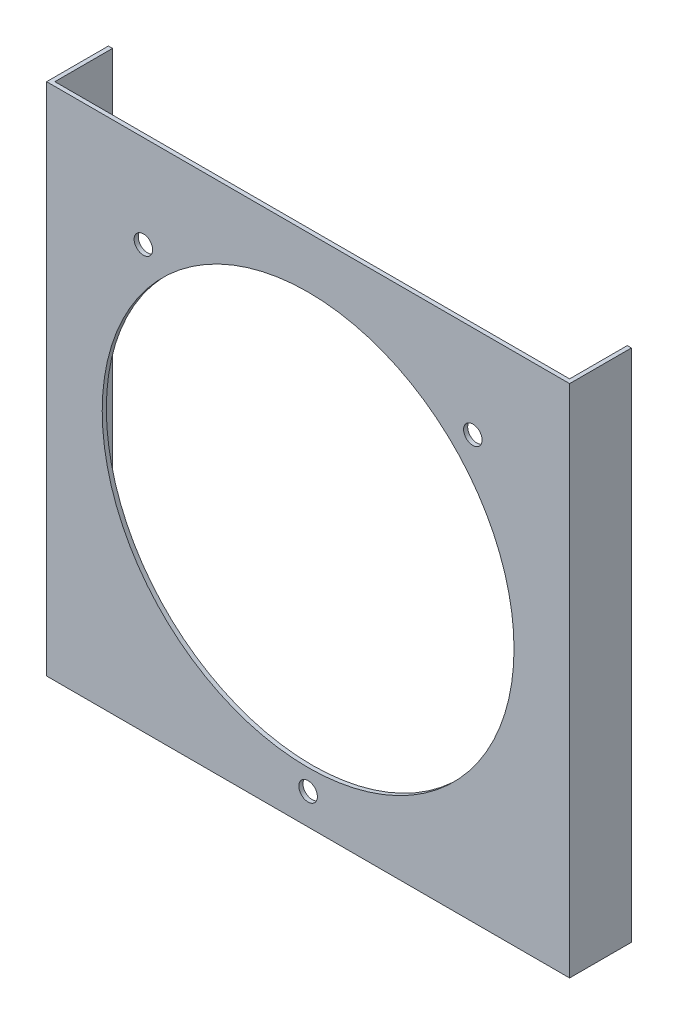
ISO-10303-21;
HEADER;
FILE_DESCRIPTION(('STEP AP214'),'2;1');
FILE_NAME('part.step','',(''),(''),'','','');
FILE_SCHEMA(('AUTOMOTIVE_DESIGN { 1 0 10303 214 1 1 1 1 }'));
ENDSEC;
DATA;
#1=APPLICATION_CONTEXT('core data for automotive mechanical design processes');
#2=APPLICATION_PROTOCOL_DEFINITION('international standard','automotive_design',2000,#1);
#3=PRODUCT_CONTEXT('',#1,'mechanical');
#4=PRODUCT('Part','Part','',(#3));
#5=PRODUCT_RELATED_PRODUCT_CATEGORY('part','',(#4));
#6=PRODUCT_DEFINITION_FORMATION('','',#4);
#7=PRODUCT_DEFINITION_CONTEXT('part definition',#1,'design');
#8=PRODUCT_DEFINITION('design','',#6,#7);
#9=PRODUCT_DEFINITION_SHAPE('','',#8);
#10=(LENGTH_UNIT() NAMED_UNIT(*) SI_UNIT(.MILLI.,.METRE.));
#11=(NAMED_UNIT(*) PLANE_ANGLE_UNIT() SI_UNIT($,.RADIAN.));
#12=(NAMED_UNIT(*) SI_UNIT($,.STERADIAN.) SOLID_ANGLE_UNIT());
#13=UNCERTAINTY_MEASURE_WITH_UNIT(LENGTH_MEASURE(1.E-05),#10,'distance_accuracy_value','');
#14=(GEOMETRIC_REPRESENTATION_CONTEXT(3) GLOBAL_UNCERTAINTY_ASSIGNED_CONTEXT((#13)) GLOBAL_UNIT_ASSIGNED_CONTEXT((#10,
#11,#12)) REPRESENTATION_CONTEXT('',''));
#15=CARTESIAN_POINT('',(0.,0.,0.));
#16=DIRECTION('',(0.,0.,1.));
#17=DIRECTION('',(1.,0.,0.));
#18=AXIS2_PLACEMENT_3D('',#15,#16,#17);
#19=CARTESIAN_POINT('',(0.,2.22044604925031E-13,2.));
#20=DIRECTION('',(0.,0.,-1.));
#21=DIRECTION('',(-0.999999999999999,0.,0.));
#22=AXIS2_PLACEMENT_3D('',#19,#20,#21);
#23=PLANE('',#22);
#24=DIRECTION('',(0.999999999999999,0.,0.));
#25=VECTOR('',#24,1.);
#26=CARTESIAN_POINT('',(-125.,-125.,1.99999999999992));
#27=LINE('',#26,#25);
#28=CARTESIAN_POINT('',(-127.,-125.,1.99999999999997));
#29=VERTEX_POINT('',#28);
#30=CARTESIAN_POINT('',(127.,-125.,2.0000000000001));
#31=VERTEX_POINT('',#30);
#32=EDGE_CURVE('E11',#29,#31,#27,.T.);
#33=ORIENTED_EDGE('',*,*,#32,.T.);
#34=DIRECTION('',(0.,1.,0.));
#35=VECTOR('',#34,1.);
#36=CARTESIAN_POINT('',(127.,125.,2.00000000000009));
#37=LINE('',#36,#35);
#38=CARTESIAN_POINT('',(127.,125.,2.00000000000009));
#39=VERTEX_POINT('',#38);
#40=EDGE_CURVE('E109',#31,#39,#37,.T.);
#41=ORIENTED_EDGE('',*,*,#40,.T.);
#42=DIRECTION('',(-0.999999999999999,0.,0.));
#43=VECTOR('',#42,1.);
#44=CARTESIAN_POINT('',(-125.,125.,1.99999999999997));
#45=LINE('',#44,#43);
#46=CARTESIAN_POINT('',(-127.,125.,1.99999999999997));
#47=VERTEX_POINT('',#46);
#48=EDGE_CURVE('E50',#39,#47,#45,.T.);
#49=ORIENTED_EDGE('',*,*,#48,.T.);
#50=DIRECTION('',(0.,1.,0.));
#51=VECTOR('',#50,1.);
#52=CARTESIAN_POINT('',(-127.,125.,1.99999999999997));
#53=LINE('',#52,#51);
#54=EDGE_CURVE('E112',#29,#47,#53,.T.);
#55=ORIENTED_EDGE('',*,*,#54,.F.);
#56=EDGE_LOOP('',(#33,#41,#49,#55));
#57=FACE_BOUND('',#56,.T.);
#58=CARTESIAN_POINT('',(0.,2.22044604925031E-13,2.));
#59=DIRECTION('',(0.,0.,1.));
#60=DIRECTION('',(0.999999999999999,0.,0.));
#61=AXIS2_PLACEMENT_3D('',#58,#59,#60);
#62=CIRCLE('',#61,100.);
#63=CARTESIAN_POINT('',(99.9999999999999,2.13717932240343E-13,2.00000000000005));
#64=VERTEX_POINT('',#63);
#65=EDGE_CURVE('E182',#64,#64,#62,.T.);
#66=ORIENTED_EDGE('',*,*,#65,.F.);
#67=EDGE_LOOP('',(#66));
#68=FACE_BOUND('',#67,.T.);
#69=CARTESIAN_POINT('',(79.9999999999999,80.0000000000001,2.00000000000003));
#70=DIRECTION('',(0.,0.,1.));
#71=DIRECTION('',(0.999999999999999,0.,0.));
#72=AXIS2_PLACEMENT_3D('',#69,#70,#71);
#73=CIRCLE('',#72,4.50000000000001);
#74=CARTESIAN_POINT('',(84.4999999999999,80.0000000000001,2.00000000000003));
#75=VERTEX_POINT('',#74);
#76=EDGE_CURVE('E176',#75,#75,#73,.T.);
#77=ORIENTED_EDGE('',*,*,#76,.F.);
#78=EDGE_LOOP('',(#77));
#79=FACE_BOUND('',#78,.T.);
#80=CARTESIAN_POINT('',(-80.,80.0000000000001,2.));
#81=DIRECTION('',(0.,0.,1.));
#82=DIRECTION('',(0.999999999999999,0.,0.));
#83=AXIS2_PLACEMENT_3D('',#80,#81,#82);
#84=CIRCLE('',#83,4.50000000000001);
#85=CARTESIAN_POINT('',(-75.5,80.0000000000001,2.));
#86=VERTEX_POINT('',#85);
#87=EDGE_CURVE('E170',#86,#86,#84,.T.);
#88=ORIENTED_EDGE('',*,*,#87,.F.);
#89=EDGE_LOOP('',(#88));
#90=FACE_BOUND('',#89,.T.);
#91=CARTESIAN_POINT('',(0.,-110.,1.99999999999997));
#92=DIRECTION('',(0.,0.,1.));
#93=DIRECTION('',(0.999999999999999,0.,0.));
#94=AXIS2_PLACEMENT_3D('',#91,#92,#93);
#95=CIRCLE('',#94,4.5);
#96=CARTESIAN_POINT('',(4.5,-110.,1.99999999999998));
#97=VERTEX_POINT('',#96);
#98=EDGE_CURVE('E164',#97,#97,#95,.T.);
#99=ORIENTED_EDGE('',*,*,#98,.F.);
#100=EDGE_LOOP('',(#99));
#101=FACE_BOUND('',#100,.T.);
#102=ADVANCED_FACE('F41',(#57,#68,#79,#90,#101),#23,.F.);
#103=CARTESIAN_POINT('',(0.,0.,0.));
#104=DIRECTION('',(0.,0.,-1.));
#105=DIRECTION('',(-0.999999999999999,0.,0.));
#106=AXIS2_PLACEMENT_3D('',#103,#104,#105);
#107=PLANE('',#106);
#108=CARTESIAN_POINT('',(-80.,80.0000000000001,0.));
#109=DIRECTION('',(0.,0.,1.));
#110=DIRECTION('',(0.999999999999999,0.,0.));
#111=AXIS2_PLACEMENT_3D('',#108,#109,#110);
#112=CIRCLE('',#111,4.50000000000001);
#113=CARTESIAN_POINT('',(-75.5,80.0000000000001,0.));
#114=VERTEX_POINT('',#113);
#115=EDGE_CURVE('E167',#114,#114,#112,.T.);
#116=ORIENTED_EDGE('',*,*,#115,.T.);
#117=EDGE_LOOP('',(#116));
#118=FACE_BOUND('',#117,.T.);
#119=CARTESIAN_POINT('',(0.,0.,0.));
#120=DIRECTION('',(0.,0.,1.));
#121=DIRECTION('',(0.999999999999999,0.,0.));
#122=AXIS2_PLACEMENT_3D('',#119,#120,#121);
#123=CIRCLE('',#122,100.);
#124=CARTESIAN_POINT('',(99.9999999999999,0.,0.));
#125=VERTEX_POINT('',#124);
#126=EDGE_CURVE('E179',#125,#125,#123,.T.);
#127=ORIENTED_EDGE('',*,*,#126,.T.);
#128=EDGE_LOOP('',(#127));
#129=FACE_BOUND('',#128,.T.);
#130=DIRECTION('',(0.,1.,0.));
#131=VECTOR('',#130,1.);
#132=CARTESIAN_POINT('',(125.,-125.,1.2490009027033E-13));
#133=LINE('',#132,#131);
#134=CARTESIAN_POINT('',(125.,-125.,1.2490009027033E-13));
#135=VERTEX_POINT('',#134);
#136=CARTESIAN_POINT('',(125.,125.,0.));
#137=VERTEX_POINT('',#136);
#138=EDGE_CURVE('E185',#135,#137,#133,.T.);
#139=ORIENTED_EDGE('',*,*,#138,.F.);
#140=DIRECTION('',(0.999999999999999,0.,0.));
#141=VECTOR('',#140,1.);
#142=CARTESIAN_POINT('',(-125.,-125.,0.));
#143=LINE('',#142,#141);
#144=CARTESIAN_POINT('',(-125.,-125.,0.));
#145=VERTEX_POINT('',#144);
#146=EDGE_CURVE('E45',#145,#135,#143,.T.);
#147=ORIENTED_EDGE('',*,*,#146,.F.);
#148=DIRECTION('',(0.,-1.,0.));
#149=VECTOR('',#148,1.);
#150=CARTESIAN_POINT('',(-125.,-125.,0.));
#151=LINE('',#150,#149);
#152=CARTESIAN_POINT('',(-125.,125.,0.));
#153=VERTEX_POINT('',#152);
#154=EDGE_CURVE('E191',#153,#145,#151,.T.);
#155=ORIENTED_EDGE('',*,*,#154,.F.);
#156=DIRECTION('',(-0.999999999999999,0.,0.));
#157=VECTOR('',#156,1.);
#158=CARTESIAN_POINT('',(-125.,125.,0.));
#159=LINE('',#158,#157);
#160=EDGE_CURVE('E65',#137,#153,#159,.T.);
#161=ORIENTED_EDGE('',*,*,#160,.F.);
#162=EDGE_LOOP('',(#139,#147,#155,#161));
#163=FACE_BOUND('',#162,.T.);
#164=CARTESIAN_POINT('',(79.9999999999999,79.9999999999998,0.));
#165=DIRECTION('',(0.,0.,1.));
#166=DIRECTION('',(0.999999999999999,0.,0.));
#167=AXIS2_PLACEMENT_3D('',#164,#165,#166);
#168=CIRCLE('',#167,4.50000000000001);
#169=CARTESIAN_POINT('',(84.4999999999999,79.9999999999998,0.));
#170=VERTEX_POINT('',#169);
#171=EDGE_CURVE('E173',#170,#170,#168,.T.);
#172=ORIENTED_EDGE('',*,*,#171,.T.);
#173=EDGE_LOOP('',(#172));
#174=FACE_BOUND('',#173,.T.);
#175=CARTESIAN_POINT('',(0.,-110.,0.));
#176=DIRECTION('',(0.,0.,1.));
#177=DIRECTION('',(0.999999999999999,0.,0.));
#178=AXIS2_PLACEMENT_3D('',#175,#176,#177);
#179=CIRCLE('',#178,4.5);
#180=CARTESIAN_POINT('',(4.50000000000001,-110.,0.));
#181=VERTEX_POINT('',#180);
#182=EDGE_CURVE('E163',#181,#181,#179,.T.);
#183=ORIENTED_EDGE('',*,*,#182,.T.);
#184=EDGE_LOOP('',(#183));
#185=FACE_BOUND('',#184,.T.);
#186=ADVANCED_FACE('F219',(#118,#129,#163,#174,#185),#107,.T.);
#187=CARTESIAN_POINT('',(-125.,125.,1.99999999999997));
#188=DIRECTION('',(0.,-1.,0.));
#189=DIRECTION('',(0.,0.,-1.));
#190=AXIS2_PLACEMENT_3D('',#187,#188,#189);
#191=PLANE('',#190);
#192=ORIENTED_EDGE('',*,*,#160,.T.);
#193=DIRECTION('',(0.,0.,-1.));
#194=VECTOR('',#193,1.);
#195=CARTESIAN_POINT('',(-125.,125.,1.99999999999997));
#196=LINE('',#195,#194);
#197=CARTESIAN_POINT('',(-125.,125.,-28.));
#198=VERTEX_POINT('',#197);
#199=EDGE_CURVE('E144',#153,#198,#196,.T.);
#200=ORIENTED_EDGE('',*,*,#199,.T.);
#201=DIRECTION('',(0.999999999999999,0.,0.));
#202=VECTOR('',#201,1.);
#203=CARTESIAN_POINT('',(-127.,125.,-28.));
#204=LINE('',#203,#202);
#205=CARTESIAN_POINT('',(-127.,125.,-28.));
#206=VERTEX_POINT('',#205);
#207=EDGE_CURVE('E160',#206,#198,#204,.T.);
#208=ORIENTED_EDGE('',*,*,#207,.F.);
#209=DIRECTION('',(0.,0.,-1.));
#210=VECTOR('',#209,1.);
#211=CARTESIAN_POINT('',(-127.,125.,1.99999999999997));
#212=LINE('',#211,#210);
#213=EDGE_CURVE('E146',#47,#206,#212,.T.);
#214=ORIENTED_EDGE('',*,*,#213,.F.);
#215=ORIENTED_EDGE('',*,*,#48,.F.);
#216=DIRECTION('',(0.,0.,-1.));
#217=VECTOR('',#216,1.);
#218=CARTESIAN_POINT('',(127.,125.,2.00000000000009));
#219=LINE('',#218,#217);
#220=CARTESIAN_POINT('',(127.,125.,-27.9999999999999));
#221=VERTEX_POINT('',#220);
#222=EDGE_CURVE('E123',#39,#221,#219,.T.);
#223=ORIENTED_EDGE('',*,*,#222,.T.);
#224=DIRECTION('',(-0.999999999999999,0.,0.));
#225=VECTOR('',#224,1.);
#226=CARTESIAN_POINT('',(127.,125.,-27.9999999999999));
#227=LINE('',#226,#225);
#228=CARTESIAN_POINT('',(125.,125.,-27.9999999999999));
#229=VERTEX_POINT('',#228);
#230=EDGE_CURVE('E133',#221,#229,#227,.T.);
#231=ORIENTED_EDGE('',*,*,#230,.T.);
#232=DIRECTION('',(0.,0.,-1.));
#233=VECTOR('',#232,1.);
#234=CARTESIAN_POINT('',(125.,125.,2.00000000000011));
#235=LINE('',#234,#233);
#236=EDGE_CURVE('E124',#137,#229,#235,.T.);
#237=ORIENTED_EDGE('',*,*,#236,.F.);
#238=EDGE_LOOP('',(#192,#200,#208,#214,#215,#223,#231,#237));
#239=FACE_BOUND('',#238,.T.);
#240=ADVANCED_FACE('F43',(#239),#191,.F.);
#241=CARTESIAN_POINT('',(-125.,-125.,1.99999999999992));
#242=DIRECTION('',(0.,1.,0.));
#243=DIRECTION('',(0.,0.,1.));
#244=AXIS2_PLACEMENT_3D('',#241,#242,#243);
#245=PLANE('',#244);
#246=ORIENTED_EDGE('',*,*,#146,.T.);
#247=DIRECTION('',(0.,0.,1.));
#248=VECTOR('',#247,1.);
#249=CARTESIAN_POINT('',(125.,-125.,2.00000000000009));
#250=LINE('',#249,#248);
#251=CARTESIAN_POINT('',(125.,-125.,-27.9999999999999));
#252=VERTEX_POINT('',#251);
#253=EDGE_CURVE('E134',#252,#135,#250,.T.);
#254=ORIENTED_EDGE('',*,*,#253,.F.);
#255=DIRECTION('',(-0.999999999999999,0.,0.));
#256=VECTOR('',#255,1.);
#257=CARTESIAN_POINT('',(127.,-125.,-27.9999999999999));
#258=LINE('',#257,#256);
#259=CARTESIAN_POINT('',(127.,-125.,-27.9999999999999));
#260=VERTEX_POINT('',#259);
#261=EDGE_CURVE('E127',#260,#252,#258,.T.);
#262=ORIENTED_EDGE('',*,*,#261,.F.);
#263=DIRECTION('',(0.,0.,1.));
#264=VECTOR('',#263,1.);
#265=CARTESIAN_POINT('',(127.,-125.,2.0000000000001));
#266=LINE('',#265,#264);
#267=EDGE_CURVE('E120',#260,#31,#266,.T.);
#268=ORIENTED_EDGE('',*,*,#267,.T.);
#269=ORIENTED_EDGE('',*,*,#32,.F.);
#270=DIRECTION('',(0.,0.,1.));
#271=VECTOR('',#270,1.);
#272=CARTESIAN_POINT('',(-127.,-125.,1.99999999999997));
#273=LINE('',#272,#271);
#274=CARTESIAN_POINT('',(-127.,-125.,-28.));
#275=VERTEX_POINT('',#274);
#276=EDGE_CURVE('E151',#275,#29,#273,.T.);
#277=ORIENTED_EDGE('',*,*,#276,.F.);
#278=DIRECTION('',(0.999999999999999,0.,0.));
#279=VECTOR('',#278,1.);
#280=CARTESIAN_POINT('',(-127.,-125.,-28.));
#281=LINE('',#280,#279);
#282=CARTESIAN_POINT('',(-125.,-125.,-28.));
#283=VERTEX_POINT('',#282);
#284=EDGE_CURVE('E153',#275,#283,#281,.T.);
#285=ORIENTED_EDGE('',*,*,#284,.T.);
#286=DIRECTION('',(0.,0.,1.));
#287=VECTOR('',#286,1.);
#288=CARTESIAN_POINT('',(-125.,-125.,1.99999999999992));
#289=LINE('',#288,#287);
#290=EDGE_CURVE('E147',#283,#145,#289,.T.);
#291=ORIENTED_EDGE('',*,*,#290,.T.);
#292=EDGE_LOOP('',(#246,#254,#262,#268,#269,#277,#285,#291));
#293=FACE_BOUND('',#292,.T.);
#294=ADVANCED_FACE('F126',(#293),#245,.F.);
#295=CARTESIAN_POINT('',(0.,2.22044604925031E-13,2.));
#296=DIRECTION('',(0.,0.,-1.));
#297=DIRECTION('',(-0.999999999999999,0.,0.));
#298=AXIS2_PLACEMENT_3D('',#295,#296,#297);
#299=CYLINDRICAL_SURFACE('',#298,100.);
#300=ORIENTED_EDGE('',*,*,#65,.T.);
#301=EDGE_LOOP('',(#300));
#302=FACE_BOUND('',#301,.T.);
#303=ORIENTED_EDGE('',*,*,#126,.F.);
#304=EDGE_LOOP('',(#303));
#305=FACE_BOUND('',#304,.T.);
#306=ADVANCED_FACE('F227',(#302,#305),#299,.F.);
#307=CARTESIAN_POINT('',(79.9999999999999,80.0000000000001,2.00000000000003));
#308=DIRECTION('',(0.,0.,-1.));
#309=DIRECTION('',(-0.999999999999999,0.,0.));
#310=AXIS2_PLACEMENT_3D('',#307,#308,#309);
#311=CYLINDRICAL_SURFACE('',#310,4.50000000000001);
#312=ORIENTED_EDGE('',*,*,#76,.T.);
#313=EDGE_LOOP('',(#312));
#314=FACE_BOUND('',#313,.T.);
#315=ORIENTED_EDGE('',*,*,#171,.F.);
#316=EDGE_LOOP('',(#315));
#317=FACE_BOUND('',#316,.T.);
#318=ADVANCED_FACE('F234',(#314,#317),#311,.F.);
#319=CARTESIAN_POINT('',(-80.,80.0000000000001,2.));
#320=DIRECTION('',(0.,0.,-1.));
#321=DIRECTION('',(-0.999999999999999,0.,0.));
#322=AXIS2_PLACEMENT_3D('',#319,#320,#321);
#323=CYLINDRICAL_SURFACE('',#322,4.50000000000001);
#324=ORIENTED_EDGE('',*,*,#87,.T.);
#325=EDGE_LOOP('',(#324));
#326=FACE_BOUND('',#325,.T.);
#327=ORIENTED_EDGE('',*,*,#115,.F.);
#328=EDGE_LOOP('',(#327));
#329=FACE_BOUND('',#328,.T.);
#330=ADVANCED_FACE('F270',(#326,#329),#323,.F.);
#331=CARTESIAN_POINT('',(0.,-110.,1.99999999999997));
#332=DIRECTION('',(0.,0.,-1.));
#333=DIRECTION('',(-0.999999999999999,0.,0.));
#334=AXIS2_PLACEMENT_3D('',#331,#332,#333);
#335=CYLINDRICAL_SURFACE('',#334,4.5);
#336=ORIENTED_EDGE('',*,*,#98,.T.);
#337=EDGE_LOOP('',(#336));
#338=FACE_BOUND('',#337,.T.);
#339=ORIENTED_EDGE('',*,*,#182,.F.);
#340=EDGE_LOOP('',(#339));
#341=FACE_BOUND('',#340,.T.);
#342=ADVANCED_FACE('F215',(#338,#341),#335,.F.);
#343=CARTESIAN_POINT('',(-127.,125.,-28.));
#344=DIRECTION('',(0.,0.,1.));
#345=DIRECTION('',(0.,-1.,0.));
#346=AXIS2_PLACEMENT_3D('',#343,#344,#345);
#347=PLANE('',#346);
#348=DIRECTION('',(0.,-1.,0.));
#349=VECTOR('',#348,1.);
#350=CARTESIAN_POINT('',(-125.,125.,-28.));
#351=LINE('',#350,#349);
#352=EDGE_CURVE('E155',#198,#283,#351,.T.);
#353=ORIENTED_EDGE('',*,*,#352,.T.);
#354=ORIENTED_EDGE('',*,*,#284,.F.);
#355=DIRECTION('',(0.,-1.,0.));
#356=VECTOR('',#355,1.);
#357=CARTESIAN_POINT('',(-127.,125.,-28.));
#358=LINE('',#357,#356);
#359=EDGE_CURVE('E149',#206,#275,#358,.T.);
#360=ORIENTED_EDGE('',*,*,#359,.F.);
#361=ORIENTED_EDGE('',*,*,#207,.T.);
#362=EDGE_LOOP('',(#353,#354,#360,#361));
#363=FACE_BOUND('',#362,.T.);
#364=ADVANCED_FACE('F202',(#363),#347,.F.);
#365=CARTESIAN_POINT('',(-127.,0.,-1.2490009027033E-13));
#366=DIRECTION('',(0.999999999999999,0.,0.));
#367=DIRECTION('',(0.,0.,-1.));
#368=AXIS2_PLACEMENT_3D('',#365,#366,#367);
#369=PLANE('',#368);
#370=ORIENTED_EDGE('',*,*,#54,.T.);
#371=ORIENTED_EDGE('',*,*,#213,.T.);
#372=ORIENTED_EDGE('',*,*,#359,.T.);
#373=ORIENTED_EDGE('',*,*,#276,.T.);
#374=EDGE_LOOP('',(#370,#371,#372,#373));
#375=FACE_BOUND('',#374,.T.);
#376=ADVANCED_FACE('F206',(#375),#369,.F.);
#377=CARTESIAN_POINT('',(-125.,-2.22044604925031E-13,-1.2490009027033E-13));
#378=DIRECTION('',(0.999999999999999,0.,0.));
#379=DIRECTION('',(0.,0.,-1.));
#380=AXIS2_PLACEMENT_3D('',#377,#378,#379);
#381=PLANE('',#380);
#382=ORIENTED_EDGE('',*,*,#199,.F.);
#383=ORIENTED_EDGE('',*,*,#154,.T.);
#384=ORIENTED_EDGE('',*,*,#290,.F.);
#385=ORIENTED_EDGE('',*,*,#352,.F.);
#386=EDGE_LOOP('',(#382,#383,#384,#385));
#387=FACE_BOUND('',#386,.T.);
#388=ADVANCED_FACE('F196',(#387),#381,.T.);
#389=CARTESIAN_POINT('',(127.,125.,-27.9999999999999));
#390=DIRECTION('',(0.,0.,-1.));
#391=DIRECTION('',(0.,1.,0.));
#392=AXIS2_PLACEMENT_3D('',#389,#390,#391);
#393=PLANE('',#392);
#394=DIRECTION('',(0.,-1.,0.));
#395=VECTOR('',#394,1.);
#396=CARTESIAN_POINT('',(125.,125.,-27.9999999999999));
#397=LINE('',#396,#395);
#398=EDGE_CURVE('E137',#229,#252,#397,.T.);
#399=ORIENTED_EDGE('',*,*,#398,.F.);
#400=ORIENTED_EDGE('',*,*,#230,.F.);
#401=DIRECTION('',(0.,-1.,0.));
#402=VECTOR('',#401,1.);
#403=CARTESIAN_POINT('',(127.,125.,-27.9999999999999));
#404=LINE('',#403,#402);
#405=EDGE_CURVE('E128',#221,#260,#404,.T.);
#406=ORIENTED_EDGE('',*,*,#405,.T.);
#407=ORIENTED_EDGE('',*,*,#261,.T.);
#408=EDGE_LOOP('',(#399,#400,#406,#407));
#409=FACE_BOUND('',#408,.T.);
#410=ADVANCED_FACE('F213',(#409),#393,.T.);
#411=CARTESIAN_POINT('',(127.,-2.22044604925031E-13,0.));
#412=DIRECTION('',(-0.999999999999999,0.,0.));
#413=DIRECTION('',(0.,0.,-1.));
#414=AXIS2_PLACEMENT_3D('',#411,#412,#413);
#415=PLANE('',#414);
#416=ORIENTED_EDGE('',*,*,#40,.F.);
#417=ORIENTED_EDGE('',*,*,#267,.F.);
#418=ORIENTED_EDGE('',*,*,#405,.F.);
#419=ORIENTED_EDGE('',*,*,#222,.F.);
#420=EDGE_LOOP('',(#416,#417,#418,#419));
#421=FACE_BOUND('',#420,.T.);
#422=ADVANCED_FACE('F118',(#421),#415,.F.);
#423=CARTESIAN_POINT('',(125.,2.22044604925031E-13,1.11022302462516E-13));
#424=DIRECTION('',(-0.999999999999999,0.,0.));
#425=DIRECTION('',(0.,0.,-1.));
#426=AXIS2_PLACEMENT_3D('',#423,#424,#425);
#427=PLANE('',#426);
#428=ORIENTED_EDGE('',*,*,#253,.T.);
#429=ORIENTED_EDGE('',*,*,#138,.T.);
#430=ORIENTED_EDGE('',*,*,#236,.T.);
#431=ORIENTED_EDGE('',*,*,#398,.T.);
#432=EDGE_LOOP('',(#428,#429,#430,#431));
#433=FACE_BOUND('',#432,.T.);
#434=ADVANCED_FACE('F310',(#433),#427,.T.);
#435=CLOSED_SHELL('',(#102,#186,#240,#294,#306,#318,#330,#342,#364,#376,#388,#410,#422,#434));
#436=MANIFOLD_SOLID_BREP('B2',#435);
#437=ADVANCED_BREP_SHAPE_REPRESENTATION('',(#18,#436),#14);
#438=SHAPE_DEFINITION_REPRESENTATION(#9,#437);
ENDSEC;
END-ISO-10303-21;
